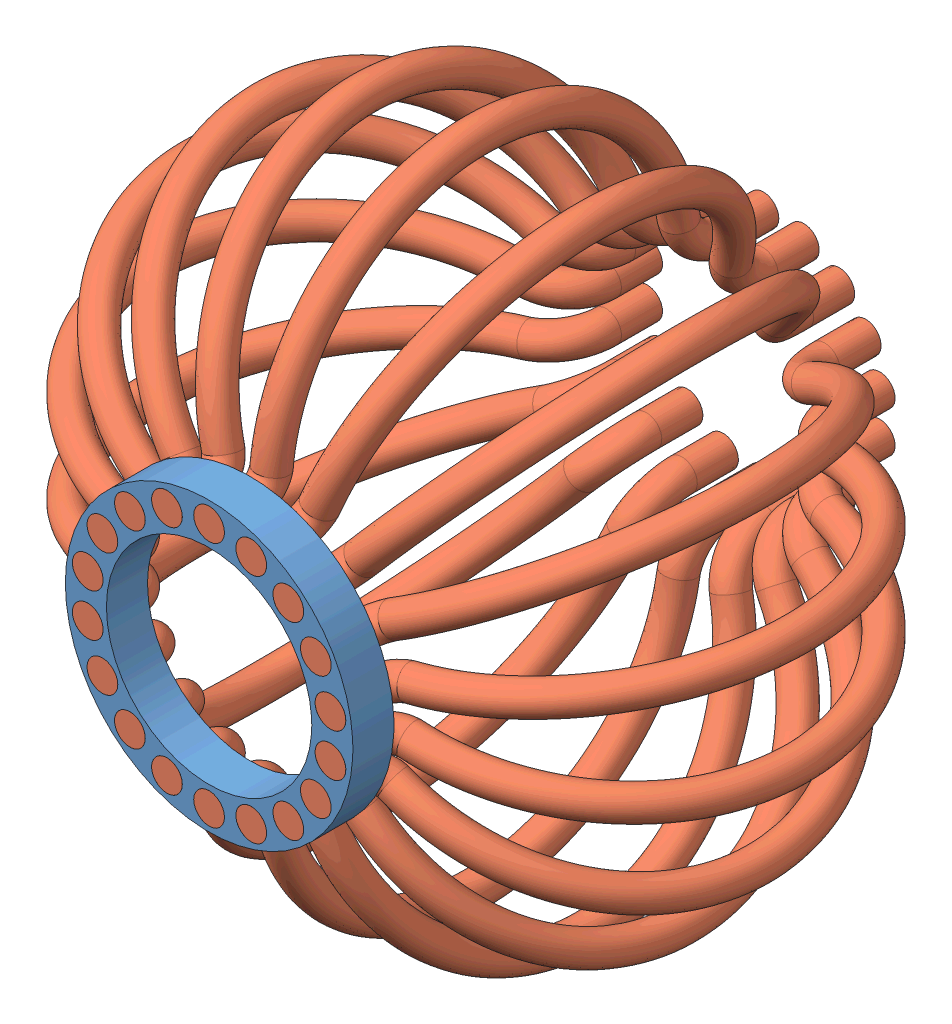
SolidWorks assembly Prototype 1- deformable grip.SLDASM, configuration Default (file format 7000). Lengths in mm.
Overall size (42.03 42.34 34.28).
19 component instances, 2 part files, 36 mates.
Components (placement in the parent):
- Prototype 1- sliding disk-1: Prototype 1- sliding disk.SLDPRT [Default] at (6.0978 8.0172 14.789) size (17.78 17.78 2.54)
- Prototype 1- spring steel wire-1: Prototype 1- spring steel wire.SLDPRT [Default] at (6.0978 8.0172 14.789) size (1.91 14.82 34.28)
- Prototype 1- spring steel wire-5: Prototype 1- spring steel wire.SLDPRT [Default] at (6.1103 8.0218 14.789) x (0.939094 0.34366 0) z (0 0 1) size (1.91 14.82 34.28)
- Prototype 1- spring steel wire-6: Prototype 1- spring steel wire.SLDPRT [Default] at (6.1474 8.0592 14.789) x (0.760539 0.649292 0) z (0 0 1) size (1.91 14.82 34.28)
- Prototype 1- spring steel wire-7: Prototype 1- spring steel wire.SLDPRT [Default] at (6.1067 8.0327 14.789) x (0.497975 0.867191 0) z (0 0 1) size (1.91 14.82 34.28)
- Prototype 1- spring steel wire-8: Prototype 1- spring steel wire.SLDPRT [Default] at (6.0905 7.9761 14.789) x (0.179043 0.983841 0) z (0 0 1) size (1.91 14.82 34.28)
- Prototype 1- spring steel wire-9: Prototype 1- spring steel wire.SLDPRT [Default] at (6.0932 8.0433 14.789) x (-0.177073 0.984198 0) z (0 0 1) size (1.91 14.82 34.28)
- Prototype 1- spring steel wire-10: Prototype 1- spring steel wire.SLDPRT [Default] at (6.1181 7.9819 14.789) x (-0.495367 0.868684 0) z (0 0 1) size (1.91 14.82 34.28)
- Prototype 1- spring steel wire-11: Prototype 1- spring steel wire.SLDPRT [Default] at (6.0797 8.0324 14.789) x (-0.768031 0.640412 0) z (0 0 1) size (1.91 14.82 34.28)
- Prototype 1- spring steel wire-12: Prototype 1- spring steel wire.SLDPRT [Default] at (6.0695 8.0275 14.789) x (-0.941038 0.3383 0) z (0 0 1) size (1.91 14.82 34.28)
- Prototype 1- spring steel wire-13: Prototype 1- spring steel wire.SLDPRT [Default] at (6.1242 8.0172 14.789) x (-0.999994 0.003452 0) z (0 0 1) size (1.91 14.82 34.28)
- Prototype 1- spring steel wire-14: Prototype 1- spring steel wire.SLDPRT [Default] at (6.1028 8.019 14.789) x (-0.939927 -0.341375 0) z (0 0 1) size (1.91 14.82 34.28)
- Prototype 1- spring steel wire-15: Prototype 1- spring steel wire.SLDPRT [Default] at (6.118 8.0341 14.789) x (-0.768254 -0.640145 0) z (0 0 1) size (1.91 14.82 34.28)
- Prototype 1- spring steel wire-16: Prototype 1- spring steel wire.SLDPRT [Default] at (6.0902 8.0039 14.789) x (-0.49825 -0.867033 0) z (0 0 1) size (1.91 14.82 34.28)
- Prototype 1- spring steel wire-17: Prototype 1- spring steel wire.SLDPRT [Default] at (6.0972 8.0137 14.789) x (-0.173179 -0.98489 0) z (0 0 1) size (1.91 14.82 34.28)
- Prototype 1- spring steel wire-18: Prototype 1- spring steel wire.SLDPRT [Default] at (6.0939 8.0399 14.789) x (0.17068 -0.985327 0) z (0 0 1) size (1.91 14.82 34.28)
- Prototype 1- spring steel wire-19: Prototype 1- spring steel wire.SLDPRT [Default] at (6.1022 8.0097 14.789) x (0.500995 -0.86545 0) z (0 0 1) size (1.91 14.82 34.28)
- Prototype 1- spring steel wire-20: Prototype 1- spring steel wire.SLDPRT [Default] at (6.0879 8.0256 14.789) x (0.764949 -0.644091 0) z (0 0 1) size (1.91 14.82 34.28)
- Prototype 1- spring steel wire-21: Prototype 1- spring steel wire.SLDPRT [Default] at (6.0954 8.0181 14.789) x (0.939577 -0.342339 0) z (0 0 1) size (1.91 14.82 34.28)
Mates (geometry in assembly coordinates):
- Coincident23: coincident aligned: plane of Prototype 1- sliding disk-1 through (6.0978 8.0172 17.329) normal (0 0 1); plane of Prototype 1- spring steel wire-1 through (6.0978 15.6372 17.329) normal (0 0 1)
- Concentric1: concentric aligned: circle of Prototype 1- sliding disk-1; circle of Prototype 1- spring steel wire-1
- Coincident5: coincident aligned: plane of Prototype 1- sliding disk-1 through (6.0978 8.0172 17.329) normal (0 0 1); plane of Prototype 1- spring steel wire-5 through (3.4917 15.1777 17.329) normal (0 0 1)
- Concentric5: concentric aligned: circle of Prototype 1- sliding disk-1; circle of Prototype 1- spring steel wire-5
- Coincident6: coincident aligned: plane of Prototype 1- sliding disk-1 through (6.0978 8.0172 17.329) normal (0 0 1); plane of Prototype 1- spring steel wire-6 through (1.1998 13.8545 17.329) normal (0 0 1)
- Concentric6: concentric aligned: circle of Prototype 1- sliding disk-1; circle of Prototype 1- spring steel wire-6
- Coincident7: coincident aligned: plane of Prototype 1- sliding disk-1 through (6.0978 8.0172 17.329) normal (0 0 1); plane of Prototype 1- spring steel wire-7 through (-0.5013 11.8272 17.329) normal (0 0 1)
- Concentric8: concentric aligned: circle of Prototype 1- sliding disk-1; circle of Prototype 1- spring steel wire-7
- Coincident8: coincident aligned: plane of Prototype 1- sliding disk-1 through (6.0978 8.0172 17.329) normal (0 0 1); plane of Prototype 1- spring steel wire-8 through (-1.4064 9.3404 17.329) normal (0 0 1)
- Concentric9: concentric aligned: circle of Prototype 1- sliding disk-1; circle of Prototype 1- spring steel wire-8
- Coincident9: coincident aligned: plane of Prototype 1- sliding disk-1 through (6.0978 8.0172 17.329) normal (0 0 1); plane of Prototype 1- spring steel wire-9 through (-1.4064 6.694 17.329) normal (0 0 1)
- Concentric10: concentric aligned: circle of Prototype 1- sliding disk-1; circle of Prototype 1- spring steel wire-9
- Coincident10: coincident aligned: plane of Prototype 1- sliding disk-1 through (6.0978 8.0172 17.329) normal (0 0 1); plane of Prototype 1- spring steel wire-10 through (-0.5013 4.2072 17.329) normal (0 0 1)
- Concentric11: concentric aligned: circle of Prototype 1- sliding disk-1; circle of Prototype 1- spring steel wire-10
- Coincident11: coincident aligned: plane of Prototype 1- sliding disk-1 through (6.0978 8.0172 17.329) normal (0 0 1); plane of Prototype 1- spring steel wire-11 through (1.1998 2.18 17.329) normal (0 0 1)
- Concentric12: concentric aligned: circle of Prototype 1- sliding disk-1; circle of Prototype 1- spring steel wire-11
- Coincident12: coincident aligned: plane of Prototype 1- sliding disk-1 through (6.0978 8.0172 17.329) normal (0 0 1); plane of Prototype 1- spring steel wire-12 through (3.4917 0.8568 17.329) normal (0 0 1)
- Concentric13: concentric aligned: circle of Prototype 1- sliding disk-1; circle of Prototype 1- spring steel wire-12
- Coincident13: coincident aligned: plane of Prototype 1- sliding disk-1 through (6.0978 8.0172 17.329) normal (0 0 1); plane of Prototype 1- spring steel wire-13 through (6.0978 0.3972 17.329) normal (0 0 1)
- Concentric14: concentric aligned: circle of Prototype 1- sliding disk-1; circle of Prototype 1- spring steel wire-13
- Coincident14: coincident aligned: plane of Prototype 1- sliding disk-1 through (6.0978 8.0172 17.329) normal (0 0 1); plane of Prototype 1- spring steel wire-14 through (8.704 0.8568 17.329) normal (0 0 1)
- Concentric15: concentric aligned: circle of Prototype 1- sliding disk-1; circle of Prototype 1- spring steel wire-14
- Coincident15: coincident aligned: plane of Prototype 1- sliding disk-1 through (6.0978 8.0172 17.329) normal (0 0 1); plane of Prototype 1- spring steel wire-15 through (10.9959 2.18 17.329) normal (0 0 1)
- Concentric16: concentric aligned: circle of Prototype 1- sliding disk-1; circle of Prototype 1- spring steel wire-15
- Coincident16: coincident aligned: plane of Prototype 1- sliding disk-1 through (6.0978 8.0172 17.329) normal (0 0 1); plane of Prototype 1- spring steel wire-16 through (12.697 4.2072 17.329) normal (0 0 1)
- Concentric17: concentric aligned: circle of Prototype 1- sliding disk-1; circle of Prototype 1- spring steel wire-16
- Coincident17: coincident aligned: plane of Prototype 1- sliding disk-1 through (6.0978 8.0172 17.329) normal (0 0 1); plane of Prototype 1- spring steel wire-17 through (13.6021 6.694 17.329) normal (0 0 1)
- Concentric18: concentric aligned: circle of Prototype 1- sliding disk-1; circle of Prototype 1- spring steel wire-17
- Coincident18: coincident aligned: plane of Prototype 1- sliding disk-1 through (6.0978 8.0172 17.329) normal (0 0 1); plane of Prototype 1- spring steel wire-18 through (13.6021 9.3404 17.329) normal (0 0 1)
- Concentric19: concentric aligned: circle of Prototype 1- sliding disk-1; circle of Prototype 1- spring steel wire-18
- Coincident19: coincident aligned: plane of Prototype 1- sliding disk-1 through (6.0978 8.0172 17.329) normal (0 0 1); plane of Prototype 1- spring steel wire-19 through (12.697 11.8272 17.329) normal (0 0 1)
- Concentric20: concentric aligned: circle of Prototype 1- sliding disk-1; circle of Prototype 1- spring steel wire-19
- Coincident20: coincident aligned: plane of Prototype 1- sliding disk-1 through (6.0978 8.0172 17.329) normal (0 0 1); plane of Prototype 1- spring steel wire-20 through (10.9959 13.8545 17.329) normal (0 0 1)
- Concentric21: concentric aligned: circle of Prototype 1- sliding disk-1; circle of Prototype 1- spring steel wire-20
- Coincident21: coincident aligned: plane of Prototype 1- sliding disk-1 through (6.0978 8.0172 17.329) normal (0 0 1); plane of Prototype 1- spring steel wire-21 through (8.704 15.1777 17.329) normal (0 0 1)
- Concentric22: concentric aligned: circle of Prototype 1- sliding disk-1; circle of Prototype 1- spring steel wire-21
